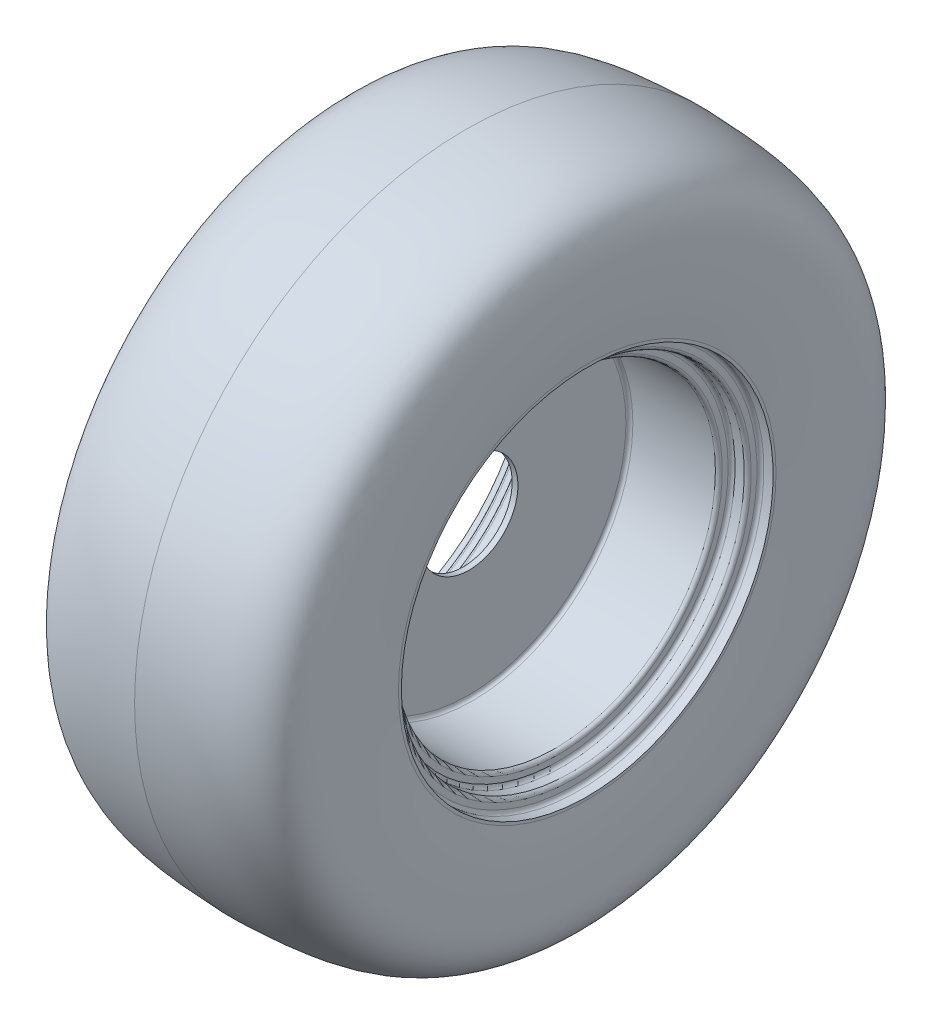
ISO-10303-21;
HEADER;
FILE_DESCRIPTION(('STEP AP214'),'2;1');
FILE_NAME('part.step','',(''),(''),'','','');
FILE_SCHEMA(('AUTOMOTIVE_DESIGN { 1 0 10303 214 1 1 1 1 }'));
ENDSEC;
DATA;
#1=APPLICATION_CONTEXT('core data for automotive mechanical design processes');
#2=APPLICATION_PROTOCOL_DEFINITION('international standard','automotive_design',2000,#1);
#3=PRODUCT_CONTEXT('',#1,'mechanical');
#4=PRODUCT('Part','Part','',(#3));
#5=PRODUCT_RELATED_PRODUCT_CATEGORY('part','',(#4));
#6=PRODUCT_DEFINITION_FORMATION('','',#4);
#7=PRODUCT_DEFINITION_CONTEXT('part definition',#1,'design');
#8=PRODUCT_DEFINITION('design','',#6,#7);
#9=PRODUCT_DEFINITION_SHAPE('','',#8);
#10=(LENGTH_UNIT() NAMED_UNIT(*) SI_UNIT(.MILLI.,.METRE.));
#11=(NAMED_UNIT(*) PLANE_ANGLE_UNIT() SI_UNIT($,.RADIAN.));
#12=(NAMED_UNIT(*) SI_UNIT($,.STERADIAN.) SOLID_ANGLE_UNIT());
#13=UNCERTAINTY_MEASURE_WITH_UNIT(LENGTH_MEASURE(1.E-05),#10,'distance_accuracy_value','');
#14=(GEOMETRIC_REPRESENTATION_CONTEXT(3) GLOBAL_UNCERTAINTY_ASSIGNED_CONTEXT((#13)) GLOBAL_UNIT_ASSIGNED_CONTEXT((#10,
#11,#12)) REPRESENTATION_CONTEXT('',''));
#15=CARTESIAN_POINT('',(0.,0.,0.));
#16=DIRECTION('',(0.,0.,1.));
#17=DIRECTION('',(1.,0.,0.));
#18=AXIS2_PLACEMENT_3D('',#15,#16,#17);
#19=CARTESIAN_POINT('',(105.,0.,-163.5));
#20=CARTESIAN_POINT('',(105.739330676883,0.,-172.08092103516));
#21=CARTESIAN_POINT('',(107.459659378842,0.,-192.047635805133));
#22=CARTESIAN_POINT('',(107.400956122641,0.,-220.381127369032));
#23=CARTESIAN_POINT('',(109.617233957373,0.,-283.009080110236));
#24=CARTESIAN_POINT('',(48.8582227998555,0.,-285.221180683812));
#25=CARTESIAN_POINT('',(0.,0.,-287.));
#26=B_SPLINE_CURVE_WITH_KNOTS('',3,(#19,#20,#21,#22,#23,#24,#25),.UNSPECIFIED.,.F.,.F.,(4,1,1,1,
4),(0.,0.128976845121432,0.300112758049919,0.437198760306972,1.),.UNSPECIFIED.);
#27=CARTESIAN_POINT('',(-61.1869721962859,0.,0.));
#28=DIRECTION('',(-1.,0.,0.));
#29=AXIS1_PLACEMENT('',#27,#28);
#30=SURFACE_OF_REVOLUTION('',#26,#29);
#31=CARTESIAN_POINT('',(0.,0.,0.));
#32=DIRECTION('',(-1.,0.,0.));
#33=DIRECTION('',(0.,0.,1.));
#34=AXIS2_PLACEMENT_3D('',#31,#32,#33);
#35=CIRCLE('',#34,287.);
#36=CARTESIAN_POINT('',(0.,0.,287.));
#37=VERTEX_POINT('',#36);
#38=EDGE_CURVE('E10',#37,#37,#35,.T.);
#39=ORIENTED_EDGE('',*,*,#38,.F.);
#40=EDGE_LOOP('',(#39));
#41=FACE_BOUND('',#40,.T.);
#42=CARTESIAN_POINT('',(105.,0.,0.));
#43=DIRECTION('',(-1.,0.,0.));
#44=DIRECTION('',(0.,0.,1.));
#45=AXIS2_PLACEMENT_3D('',#42,#43,#44);
#46=CIRCLE('',#45,163.5);
#47=CARTESIAN_POINT('',(105.,0.,163.5));
#48=VERTEX_POINT('',#47);
#49=EDGE_CURVE('E115',#48,#48,#46,.T.);
#50=ORIENTED_EDGE('',*,*,#49,.T.);
#51=EDGE_LOOP('',(#50));
#52=FACE_BOUND('',#51,.T.);
#53=ADVANCED_FACE('F29',(#41,#52),#30,.T.);
#54=CARTESIAN_POINT('',(0.,0.,-287.));
#55=CARTESIAN_POINT('',(-48.8582227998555,0.,-285.221180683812));
#56=CARTESIAN_POINT('',(-109.617233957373,0.,-283.009080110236));
#57=CARTESIAN_POINT('',(-107.400956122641,0.,-220.381127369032));
#58=CARTESIAN_POINT('',(-107.459659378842,0.,-192.047635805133));
#59=CARTESIAN_POINT('',(-105.739330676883,0.,-172.08092103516));
#60=CARTESIAN_POINT('',(-105.,0.,-163.5));
#61=B_SPLINE_CURVE_WITH_KNOTS('',3,(#54,#55,#56,#57,#58,#59,#60),.UNSPECIFIED.,.F.,.F.,(4,1,1,1,
4),(0.,0.562801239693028,0.699887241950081,0.871023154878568,1.),.UNSPECIFIED.);
#62=CARTESIAN_POINT('',(-61.1869721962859,0.,0.));
#63=DIRECTION('',(-1.,0.,0.));
#64=AXIS1_PLACEMENT('',#62,#63);
#65=SURFACE_OF_REVOLUTION('',#61,#64);
#66=CARTESIAN_POINT('',(-105.,0.,0.));
#67=DIRECTION('',(-1.,0.,0.));
#68=DIRECTION('',(0.,0.,1.));
#69=AXIS2_PLACEMENT_3D('',#66,#67,#68);
#70=CIRCLE('',#69,163.5);
#71=CARTESIAN_POINT('',(-105.,0.,163.5));
#72=VERTEX_POINT('',#71);
#73=EDGE_CURVE('E36',#72,#72,#70,.T.);
#74=ORIENTED_EDGE('',*,*,#73,.F.);
#75=EDGE_LOOP('',(#74));
#76=FACE_BOUND('',#75,.T.);
#77=ORIENTED_EDGE('',*,*,#38,.T.);
#78=EDGE_LOOP('',(#77));
#79=FACE_BOUND('',#78,.T.);
#80=ADVANCED_FACE('F127',(#76,#79),#65,.T.);
#81=CARTESIAN_POINT('',(-105.,0.,-163.5));
#82=DIRECTION('',(1.,0.,0.));
#83=DIRECTION('',(0.,0.,-1.));
#84=AXIS2_PLACEMENT_3D('',#81,#82,#83);
#85=PLANE('',#84);
#86=CARTESIAN_POINT('',(-105.,0.,0.));
#87=DIRECTION('',(-1.,0.,0.));
#88=DIRECTION('',(0.,0.,1.));
#89=AXIS2_PLACEMENT_3D('',#86,#87,#88);
#90=CIRCLE('',#89,161.);
#91=CARTESIAN_POINT('',(-105.,0.,161.));
#92=VERTEX_POINT('',#91);
#93=EDGE_CURVE('E40',#92,#92,#90,.T.);
#94=ORIENTED_EDGE('',*,*,#93,.F.);
#95=EDGE_LOOP('',(#94));
#96=FACE_BOUND('',#95,.T.);
#97=ORIENTED_EDGE('',*,*,#73,.T.);
#98=EDGE_LOOP('',(#97));
#99=FACE_BOUND('',#98,.T.);
#100=ADVANCED_FACE('F130',(#96,#99),#85,.F.);
#101=CARTESIAN_POINT('',(-61.1869721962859,0.,0.));
#102=DIRECTION('',(-1.,0.,0.));
#103=DIRECTION('',(0.,0.,1.));
#104=AXIS2_PLACEMENT_3D('',#101,#102,#103);
#105=CYLINDRICAL_SURFACE('',#104,161.);
#106=CARTESIAN_POINT('',(-97.,0.,0.));
#107=DIRECTION('',(-1.,0.,0.));
#108=DIRECTION('',(0.,0.,1.));
#109=AXIS2_PLACEMENT_3D('',#106,#107,#108);
#110=CIRCLE('',#109,161.);
#111=CARTESIAN_POINT('',(-97.,0.,161.));
#112=VERTEX_POINT('',#111);
#113=EDGE_CURVE('E44',#112,#112,#110,.T.);
#114=ORIENTED_EDGE('',*,*,#113,.F.);
#115=EDGE_LOOP('',(#114));
#116=FACE_BOUND('',#115,.T.);
#117=ORIENTED_EDGE('',*,*,#93,.T.);
#118=EDGE_LOOP('',(#117));
#119=FACE_BOUND('',#118,.T.);
#120=ADVANCED_FACE('F134',(#116,#119),#105,.F.);
#121=CARTESIAN_POINT('',(-97.,0.,0.));
#122=DIRECTION('',(-1.,0.,0.));
#123=DIRECTION('',(0.,0.,1.));
#124=AXIS2_PLACEMENT_3D('',#121,#122,#123);
#125=TOROIDAL_SURFACE('',#124,158.,3.);
#126=CARTESIAN_POINT('',(-94.,0.,0.));
#127=DIRECTION('',(-1.,0.,0.));
#128=DIRECTION('',(0.,0.,1.));
#129=AXIS2_PLACEMENT_3D('',#126,#127,#128);
#130=CIRCLE('',#129,158.);
#131=CARTESIAN_POINT('',(-94.,0.,158.));
#132=VERTEX_POINT('',#131);
#133=EDGE_CURVE('E49',#132,#132,#130,.T.);
#134=ORIENTED_EDGE('',*,*,#133,.F.);
#135=EDGE_LOOP('',(#134));
#136=FACE_BOUND('',#135,.T.);
#137=ORIENTED_EDGE('',*,*,#113,.T.);
#138=EDGE_LOOP('',(#137));
#139=FACE_BOUND('',#138,.T.);
#140=ADVANCED_FACE('F138',(#136,#139),#125,.F.);
#141=CARTESIAN_POINT('',(-94.,0.,-158.));
#142=DIRECTION('',(1.,0.,0.));
#143=DIRECTION('',(0.,0.,-1.));
#144=AXIS2_PLACEMENT_3D('',#141,#142,#143);
#145=PLANE('',#144);
#146=CARTESIAN_POINT('',(-94.,0.,0.));
#147=DIRECTION('',(-1.,0.,0.));
#148=DIRECTION('',(0.,0.,1.));
#149=AXIS2_PLACEMENT_3D('',#146,#147,#148);
#150=CIRCLE('',#149,153.);
#151=CARTESIAN_POINT('',(-94.,0.,153.));
#152=VERTEX_POINT('',#151);
#153=EDGE_CURVE('E52',#152,#152,#150,.T.);
#154=ORIENTED_EDGE('',*,*,#153,.F.);
#155=EDGE_LOOP('',(#154));
#156=FACE_BOUND('',#155,.T.);
#157=ORIENTED_EDGE('',*,*,#133,.T.);
#158=EDGE_LOOP('',(#157));
#159=FACE_BOUND('',#158,.T.);
#160=ADVANCED_FACE('F142',(#156,#159),#145,.F.);
#161=CARTESIAN_POINT('',(-91.,0.,0.));
#162=DIRECTION('',(-1.,0.,0.));
#163=DIRECTION('',(0.,0.,1.));
#164=AXIS2_PLACEMENT_3D('',#161,#162,#163);
#165=TOROIDAL_SURFACE('',#164,153.,3.);
#166=CARTESIAN_POINT('',(-91.,0.,0.));
#167=DIRECTION('',(-1.,0.,0.));
#168=DIRECTION('',(0.,0.,1.));
#169=AXIS2_PLACEMENT_3D('',#166,#167,#168);
#170=CIRCLE('',#169,150.);
#171=CARTESIAN_POINT('',(-91.,0.,150.));
#172=VERTEX_POINT('',#171);
#173=EDGE_CURVE('E55',#172,#172,#170,.T.);
#174=ORIENTED_EDGE('',*,*,#173,.F.);
#175=EDGE_LOOP('',(#174));
#176=FACE_BOUND('',#175,.T.);
#177=ORIENTED_EDGE('',*,*,#153,.T.);
#178=EDGE_LOOP('',(#177));
#179=FACE_BOUND('',#178,.T.);
#180=ADVANCED_FACE('F146',(#176,#179),#165,.T.);
#181=CARTESIAN_POINT('',(-61.1869721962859,0.,0.));
#182=DIRECTION('',(-1.,0.,0.));
#183=DIRECTION('',(0.,0.,1.));
#184=AXIS2_PLACEMENT_3D('',#181,#182,#183);
#185=CYLINDRICAL_SURFACE('',#184,150.);
#186=CARTESIAN_POINT('',(-83.,0.,0.));
#187=DIRECTION('',(-1.,0.,0.));
#188=DIRECTION('',(0.,0.,1.));
#189=AXIS2_PLACEMENT_3D('',#186,#187,#188);
#190=CIRCLE('',#189,150.);
#191=CARTESIAN_POINT('',(-83.,0.,150.));
#192=VERTEX_POINT('',#191);
#193=EDGE_CURVE('E58',#192,#192,#190,.T.);
#194=ORIENTED_EDGE('',*,*,#193,.F.);
#195=EDGE_LOOP('',(#194));
#196=FACE_BOUND('',#195,.T.);
#197=ORIENTED_EDGE('',*,*,#173,.T.);
#198=EDGE_LOOP('',(#197));
#199=FACE_BOUND('',#198,.T.);
#200=ADVANCED_FACE('F150',(#196,#199),#185,.F.);
#201=CARTESIAN_POINT('',(-83.,0.,0.));
#202=DIRECTION('',(-1.,0.,0.));
#203=DIRECTION('',(0.,0.,1.));
#204=AXIS2_PLACEMENT_3D('',#201,#202,#203);
#205=TOROIDAL_SURFACE('',#204,147.,3.);
#206=CARTESIAN_POINT('',(-80.,0.,0.));
#207=DIRECTION('',(-1.,0.,0.));
#208=DIRECTION('',(0.,0.,1.));
#209=AXIS2_PLACEMENT_3D('',#206,#207,#208);
#210=CIRCLE('',#209,147.);
#211=CARTESIAN_POINT('',(-80.,0.,147.));
#212=VERTEX_POINT('',#211);
#213=EDGE_CURVE('E61',#212,#212,#210,.T.);
#214=ORIENTED_EDGE('',*,*,#213,.F.);
#215=EDGE_LOOP('',(#214));
#216=FACE_BOUND('',#215,.T.);
#217=ORIENTED_EDGE('',*,*,#193,.T.);
#218=EDGE_LOOP('',(#217));
#219=FACE_BOUND('',#218,.T.);
#220=ADVANCED_FACE('F154',(#216,#219),#205,.F.);
#221=CARTESIAN_POINT('',(-80.,0.,-147.));
#222=DIRECTION('',(1.,0.,0.));
#223=DIRECTION('',(0.,0.,-1.));
#224=AXIS2_PLACEMENT_3D('',#221,#222,#223);
#225=PLANE('',#224);
#226=CARTESIAN_POINT('',(-80.,0.,0.));
#227=DIRECTION('',(-1.,0.,0.));
#228=DIRECTION('',(0.,0.,1.));
#229=AXIS2_PLACEMENT_3D('',#226,#227,#228);
#230=CIRCLE('',#229,142.);
#231=CARTESIAN_POINT('',(-80.,0.,142.));
#232=VERTEX_POINT('',#231);
#233=EDGE_CURVE('E64',#232,#232,#230,.T.);
#234=ORIENTED_EDGE('',*,*,#233,.F.);
#235=EDGE_LOOP('',(#234));
#236=FACE_BOUND('',#235,.T.);
#237=ORIENTED_EDGE('',*,*,#213,.T.);
#238=EDGE_LOOP('',(#237));
#239=FACE_BOUND('',#238,.T.);
#240=ADVANCED_FACE('F158',(#236,#239),#225,.F.);
#241=CARTESIAN_POINT('',(-77.,0.,0.));
#242=DIRECTION('',(-1.,0.,0.));
#243=DIRECTION('',(0.,0.,1.));
#244=AXIS2_PLACEMENT_3D('',#241,#242,#243);
#245=TOROIDAL_SURFACE('',#244,142.,3.);
#246=CARTESIAN_POINT('',(-77.,0.,0.));
#247=DIRECTION('',(-1.,0.,0.));
#248=DIRECTION('',(0.,0.,1.));
#249=AXIS2_PLACEMENT_3D('',#246,#247,#248);
#250=CIRCLE('',#249,139.);
#251=CARTESIAN_POINT('',(-77.,0.,139.));
#252=VERTEX_POINT('',#251);
#253=EDGE_CURVE('E67',#252,#252,#250,.T.);
#254=ORIENTED_EDGE('',*,*,#253,.F.);
#255=EDGE_LOOP('',(#254));
#256=FACE_BOUND('',#255,.T.);
#257=ORIENTED_EDGE('',*,*,#233,.T.);
#258=EDGE_LOOP('',(#257));
#259=FACE_BOUND('',#258,.T.);
#260=ADVANCED_FACE('F162',(#256,#259),#245,.T.);
#261=CARTESIAN_POINT('',(-61.1869721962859,0.,0.));
#262=DIRECTION('',(-1.,0.,0.));
#263=DIRECTION('',(0.,0.,1.));
#264=AXIS2_PLACEMENT_3D('',#261,#262,#263);
#265=CYLINDRICAL_SURFACE('',#264,139.);
#266=CARTESIAN_POINT('',(-5.50000000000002,0.,0.));
#267=DIRECTION('',(-1.,0.,0.));
#268=DIRECTION('',(0.,0.,1.));
#269=AXIS2_PLACEMENT_3D('',#266,#267,#268);
#270=CIRCLE('',#269,139.);
#271=CARTESIAN_POINT('',(-5.50000000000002,0.,139.));
#272=VERTEX_POINT('',#271);
#273=EDGE_CURVE('E70',#272,#272,#270,.T.);
#274=ORIENTED_EDGE('',*,*,#273,.F.);
#275=EDGE_LOOP('',(#274));
#276=FACE_BOUND('',#275,.T.);
#277=ORIENTED_EDGE('',*,*,#253,.T.);
#278=EDGE_LOOP('',(#277));
#279=FACE_BOUND('',#278,.T.);
#280=ADVANCED_FACE('F166',(#276,#279),#265,.F.);
#281=CARTESIAN_POINT('',(-5.5,0.,0.));
#282=DIRECTION('',(-1.,0.,0.));
#283=DIRECTION('',(0.,0.,1.));
#284=AXIS2_PLACEMENT_3D('',#281,#282,#283);
#285=TOROIDAL_SURFACE('',#284,136.,3.);
#286=CARTESIAN_POINT('',(-2.5,0.,0.));
#287=DIRECTION('',(-1.,0.,0.));
#288=DIRECTION('',(0.,0.,1.));
#289=AXIS2_PLACEMENT_3D('',#286,#287,#288);
#290=CIRCLE('',#289,136.);
#291=CARTESIAN_POINT('',(-2.5,0.,136.));
#292=VERTEX_POINT('',#291);
#293=EDGE_CURVE('E73',#292,#292,#290,.T.);
#294=ORIENTED_EDGE('',*,*,#293,.F.);
#295=EDGE_LOOP('',(#294));
#296=FACE_BOUND('',#295,.T.);
#297=ORIENTED_EDGE('',*,*,#273,.T.);
#298=EDGE_LOOP('',(#297));
#299=FACE_BOUND('',#298,.T.);
#300=ADVANCED_FACE('F170',(#296,#299),#285,.F.);
#301=CARTESIAN_POINT('',(-2.5,0.,-136.));
#302=DIRECTION('',(1.,0.,0.));
#303=DIRECTION('',(0.,0.,-1.));
#304=AXIS2_PLACEMENT_3D('',#301,#302,#303);
#305=PLANE('',#304);
#306=CARTESIAN_POINT('',(-2.49999999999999,0.,0.));
#307=DIRECTION('',(-1.,0.,0.));
#308=DIRECTION('',(0.,0.,1.));
#309=AXIS2_PLACEMENT_3D('',#306,#307,#308);
#310=CIRCLE('',#309,42.5);
#311=CARTESIAN_POINT('',(-2.49999999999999,0.,42.5));
#312=VERTEX_POINT('',#311);
#313=EDGE_CURVE('E76',#312,#312,#310,.T.);
#314=ORIENTED_EDGE('',*,*,#313,.F.);
#315=EDGE_LOOP('',(#314));
#316=FACE_BOUND('',#315,.T.);
#317=ORIENTED_EDGE('',*,*,#293,.T.);
#318=EDGE_LOOP('',(#317));
#319=FACE_BOUND('',#318,.T.);
#320=ADVANCED_FACE('F174',(#316,#319),#305,.F.);
#321=CARTESIAN_POINT('',(-61.1869721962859,0.,0.));
#322=DIRECTION('',(-1.,0.,0.));
#323=DIRECTION('',(0.,0.,1.));
#324=AXIS2_PLACEMENT_3D('',#321,#322,#323);
#325=CYLINDRICAL_SURFACE('',#324,42.5);
#326=CARTESIAN_POINT('',(2.49999999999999,0.,0.));
#327=DIRECTION('',(-1.,0.,0.));
#328=DIRECTION('',(0.,0.,1.));
#329=AXIS2_PLACEMENT_3D('',#326,#327,#328);
#330=CIRCLE('',#329,42.5);
#331=CARTESIAN_POINT('',(2.49999999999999,0.,42.5));
#332=VERTEX_POINT('',#331);
#333=EDGE_CURVE('E79',#332,#332,#330,.T.);
#334=ORIENTED_EDGE('',*,*,#333,.F.);
#335=EDGE_LOOP('',(#334));
#336=FACE_BOUND('',#335,.T.);
#337=ORIENTED_EDGE('',*,*,#313,.T.);
#338=EDGE_LOOP('',(#337));
#339=FACE_BOUND('',#338,.T.);
#340=ADVANCED_FACE('F178',(#336,#339),#325,.F.);
#341=CARTESIAN_POINT('',(2.5,0.,-136.));
#342=DIRECTION('',(-1.,0.,0.));
#343=DIRECTION('',(0.,0.,1.));
#344=AXIS2_PLACEMENT_3D('',#341,#342,#343);
#345=PLANE('',#344);
#346=CARTESIAN_POINT('',(2.5,0.,0.));
#347=DIRECTION('',(-1.,0.,0.));
#348=DIRECTION('',(0.,0.,1.));
#349=AXIS2_PLACEMENT_3D('',#346,#347,#348);
#350=CIRCLE('',#349,136.);
#351=CARTESIAN_POINT('',(2.5,0.,136.));
#352=VERTEX_POINT('',#351);
#353=EDGE_CURVE('E82',#352,#352,#350,.T.);
#354=ORIENTED_EDGE('',*,*,#353,.F.);
#355=EDGE_LOOP('',(#354));
#356=FACE_BOUND('',#355,.T.);
#357=ORIENTED_EDGE('',*,*,#333,.T.);
#358=EDGE_LOOP('',(#357));
#359=FACE_BOUND('',#358,.T.);
#360=ADVANCED_FACE('F182',(#356,#359),#345,.F.);
#361=CARTESIAN_POINT('',(5.5,0.,0.));
#362=DIRECTION('',(-1.,0.,0.));
#363=DIRECTION('',(0.,0.,1.));
#364=AXIS2_PLACEMENT_3D('',#361,#362,#363);
#365=TOROIDAL_SURFACE('',#364,136.,3.);
#366=CARTESIAN_POINT('',(5.50000000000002,0.,0.));
#367=DIRECTION('',(-1.,0.,0.));
#368=DIRECTION('',(0.,0.,1.));
#369=AXIS2_PLACEMENT_3D('',#366,#367,#368);
#370=CIRCLE('',#369,139.);
#371=CARTESIAN_POINT('',(5.50000000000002,0.,139.));
#372=VERTEX_POINT('',#371);
#373=EDGE_CURVE('E85',#372,#372,#370,.T.);
#374=ORIENTED_EDGE('',*,*,#373,.F.);
#375=EDGE_LOOP('',(#374));
#376=FACE_BOUND('',#375,.T.);
#377=ORIENTED_EDGE('',*,*,#353,.T.);
#378=EDGE_LOOP('',(#377));
#379=FACE_BOUND('',#378,.T.);
#380=ADVANCED_FACE('F186',(#376,#379),#365,.F.);
#381=CARTESIAN_POINT('',(-61.1869721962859,0.,0.));
#382=DIRECTION('',(-1.,0.,0.));
#383=DIRECTION('',(0.,0.,1.));
#384=AXIS2_PLACEMENT_3D('',#381,#382,#383);
#385=CYLINDRICAL_SURFACE('',#384,139.);
#386=CARTESIAN_POINT('',(77.,0.,0.));
#387=DIRECTION('',(-1.,0.,0.));
#388=DIRECTION('',(0.,0.,1.));
#389=AXIS2_PLACEMENT_3D('',#386,#387,#388);
#390=CIRCLE('',#389,139.);
#391=CARTESIAN_POINT('',(77.,0.,139.));
#392=VERTEX_POINT('',#391);
#393=EDGE_CURVE('E88',#392,#392,#390,.T.);
#394=ORIENTED_EDGE('',*,*,#393,.F.);
#395=EDGE_LOOP('',(#394));
#396=FACE_BOUND('',#395,.T.);
#397=ORIENTED_EDGE('',*,*,#373,.T.);
#398=EDGE_LOOP('',(#397));
#399=FACE_BOUND('',#398,.T.);
#400=ADVANCED_FACE('F190',(#396,#399),#385,.F.);
#401=CARTESIAN_POINT('',(77.,0.,0.));
#402=DIRECTION('',(-1.,0.,0.));
#403=DIRECTION('',(0.,0.,1.));
#404=AXIS2_PLACEMENT_3D('',#401,#402,#403);
#405=TOROIDAL_SURFACE('',#404,142.,3.);
#406=CARTESIAN_POINT('',(80.,0.,0.));
#407=DIRECTION('',(-1.,0.,0.));
#408=DIRECTION('',(0.,0.,1.));
#409=AXIS2_PLACEMENT_3D('',#406,#407,#408);
#410=CIRCLE('',#409,142.);
#411=CARTESIAN_POINT('',(80.,0.,142.));
#412=VERTEX_POINT('',#411);
#413=EDGE_CURVE('E91',#412,#412,#410,.T.);
#414=ORIENTED_EDGE('',*,*,#413,.F.);
#415=EDGE_LOOP('',(#414));
#416=FACE_BOUND('',#415,.T.);
#417=ORIENTED_EDGE('',*,*,#393,.T.);
#418=EDGE_LOOP('',(#417));
#419=FACE_BOUND('',#418,.T.);
#420=ADVANCED_FACE('F194',(#416,#419),#405,.T.);
#421=CARTESIAN_POINT('',(80.,0.,-147.));
#422=DIRECTION('',(-1.,0.,0.));
#423=DIRECTION('',(0.,0.,1.));
#424=AXIS2_PLACEMENT_3D('',#421,#422,#423);
#425=PLANE('',#424);
#426=CARTESIAN_POINT('',(80.,0.,0.));
#427=DIRECTION('',(-1.,0.,0.));
#428=DIRECTION('',(0.,0.,1.));
#429=AXIS2_PLACEMENT_3D('',#426,#427,#428);
#430=CIRCLE('',#429,147.);
#431=CARTESIAN_POINT('',(80.,0.,147.));
#432=VERTEX_POINT('',#431);
#433=EDGE_CURVE('E94',#432,#432,#430,.T.);
#434=ORIENTED_EDGE('',*,*,#433,.F.);
#435=EDGE_LOOP('',(#434));
#436=FACE_BOUND('',#435,.T.);
#437=ORIENTED_EDGE('',*,*,#413,.T.);
#438=EDGE_LOOP('',(#437));
#439=FACE_BOUND('',#438,.T.);
#440=ADVANCED_FACE('F198',(#436,#439),#425,.F.);
#441=CARTESIAN_POINT('',(83.,0.,0.));
#442=DIRECTION('',(-1.,0.,0.));
#443=DIRECTION('',(0.,0.,1.));
#444=AXIS2_PLACEMENT_3D('',#441,#442,#443);
#445=TOROIDAL_SURFACE('',#444,147.,3.);
#446=CARTESIAN_POINT('',(83.,0.,0.));
#447=DIRECTION('',(-1.,0.,0.));
#448=DIRECTION('',(0.,0.,1.));
#449=AXIS2_PLACEMENT_3D('',#446,#447,#448);
#450=CIRCLE('',#449,150.);
#451=CARTESIAN_POINT('',(83.,0.,150.));
#452=VERTEX_POINT('',#451);
#453=EDGE_CURVE('E97',#452,#452,#450,.T.);
#454=ORIENTED_EDGE('',*,*,#453,.F.);
#455=EDGE_LOOP('',(#454));
#456=FACE_BOUND('',#455,.T.);
#457=ORIENTED_EDGE('',*,*,#433,.T.);
#458=EDGE_LOOP('',(#457));
#459=FACE_BOUND('',#458,.T.);
#460=ADVANCED_FACE('F202',(#456,#459),#445,.F.);
#461=CARTESIAN_POINT('',(-61.1869721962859,0.,0.));
#462=DIRECTION('',(-1.,0.,0.));
#463=DIRECTION('',(0.,0.,1.));
#464=AXIS2_PLACEMENT_3D('',#461,#462,#463);
#465=CYLINDRICAL_SURFACE('',#464,150.);
#466=CARTESIAN_POINT('',(91.,0.,0.));
#467=DIRECTION('',(-1.,0.,0.));
#468=DIRECTION('',(0.,0.,1.));
#469=AXIS2_PLACEMENT_3D('',#466,#467,#468);
#470=CIRCLE('',#469,150.);
#471=CARTESIAN_POINT('',(91.,0.,150.));
#472=VERTEX_POINT('',#471);
#473=EDGE_CURVE('E100',#472,#472,#470,.T.);
#474=ORIENTED_EDGE('',*,*,#473,.F.);
#475=EDGE_LOOP('',(#474));
#476=FACE_BOUND('',#475,.T.);
#477=ORIENTED_EDGE('',*,*,#453,.T.);
#478=EDGE_LOOP('',(#477));
#479=FACE_BOUND('',#478,.T.);
#480=ADVANCED_FACE('F206',(#476,#479),#465,.F.);
#481=CARTESIAN_POINT('',(91.,0.,0.));
#482=DIRECTION('',(-1.,0.,0.));
#483=DIRECTION('',(0.,0.,1.));
#484=AXIS2_PLACEMENT_3D('',#481,#482,#483);
#485=TOROIDAL_SURFACE('',#484,153.,3.);
#486=CARTESIAN_POINT('',(94.,0.,0.));
#487=DIRECTION('',(-1.,0.,0.));
#488=DIRECTION('',(0.,0.,1.));
#489=AXIS2_PLACEMENT_3D('',#486,#487,#488);
#490=CIRCLE('',#489,153.);
#491=CARTESIAN_POINT('',(94.,0.,153.));
#492=VERTEX_POINT('',#491);
#493=EDGE_CURVE('E103',#492,#492,#490,.T.);
#494=ORIENTED_EDGE('',*,*,#493,.F.);
#495=EDGE_LOOP('',(#494));
#496=FACE_BOUND('',#495,.T.);
#497=ORIENTED_EDGE('',*,*,#473,.T.);
#498=EDGE_LOOP('',(#497));
#499=FACE_BOUND('',#498,.T.);
#500=ADVANCED_FACE('F210',(#496,#499),#485,.T.);
#501=CARTESIAN_POINT('',(94.,0.,-158.));
#502=DIRECTION('',(-1.,0.,0.));
#503=DIRECTION('',(0.,0.,1.));
#504=AXIS2_PLACEMENT_3D('',#501,#502,#503);
#505=PLANE('',#504);
#506=CARTESIAN_POINT('',(94.,0.,0.));
#507=DIRECTION('',(-1.,0.,0.));
#508=DIRECTION('',(0.,0.,1.));
#509=AXIS2_PLACEMENT_3D('',#506,#507,#508);
#510=CIRCLE('',#509,158.);
#511=CARTESIAN_POINT('',(94.,0.,158.));
#512=VERTEX_POINT('',#511);
#513=EDGE_CURVE('E106',#512,#512,#510,.T.);
#514=ORIENTED_EDGE('',*,*,#513,.F.);
#515=EDGE_LOOP('',(#514));
#516=FACE_BOUND('',#515,.T.);
#517=ORIENTED_EDGE('',*,*,#493,.T.);
#518=EDGE_LOOP('',(#517));
#519=FACE_BOUND('',#518,.T.);
#520=ADVANCED_FACE('F214',(#516,#519),#505,.F.);
#521=CARTESIAN_POINT('',(97.,0.,0.));
#522=DIRECTION('',(-1.,0.,0.));
#523=DIRECTION('',(0.,0.,1.));
#524=AXIS2_PLACEMENT_3D('',#521,#522,#523);
#525=TOROIDAL_SURFACE('',#524,158.,3.);
#526=CARTESIAN_POINT('',(97.,0.,0.));
#527=DIRECTION('',(-1.,0.,0.));
#528=DIRECTION('',(0.,0.,1.));
#529=AXIS2_PLACEMENT_3D('',#526,#527,#528);
#530=CIRCLE('',#529,161.);
#531=CARTESIAN_POINT('',(97.,0.,161.));
#532=VERTEX_POINT('',#531);
#533=EDGE_CURVE('E109',#532,#532,#530,.T.);
#534=ORIENTED_EDGE('',*,*,#533,.F.);
#535=EDGE_LOOP('',(#534));
#536=FACE_BOUND('',#535,.T.);
#537=ORIENTED_EDGE('',*,*,#513,.T.);
#538=EDGE_LOOP('',(#537));
#539=FACE_BOUND('',#538,.T.);
#540=ADVANCED_FACE('F218',(#536,#539),#525,.F.);
#541=CARTESIAN_POINT('',(-61.1869721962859,0.,0.));
#542=DIRECTION('',(-1.,0.,0.));
#543=DIRECTION('',(0.,0.,1.));
#544=AXIS2_PLACEMENT_3D('',#541,#542,#543);
#545=CYLINDRICAL_SURFACE('',#544,161.);
#546=CARTESIAN_POINT('',(105.,0.,0.));
#547=DIRECTION('',(-1.,0.,0.));
#548=DIRECTION('',(0.,0.,1.));
#549=AXIS2_PLACEMENT_3D('',#546,#547,#548);
#550=CIRCLE('',#549,161.);
#551=CARTESIAN_POINT('',(105.,0.,161.));
#552=VERTEX_POINT('',#551);
#553=EDGE_CURVE('E112',#552,#552,#550,.T.);
#554=ORIENTED_EDGE('',*,*,#553,.F.);
#555=EDGE_LOOP('',(#554));
#556=FACE_BOUND('',#555,.T.);
#557=ORIENTED_EDGE('',*,*,#533,.T.);
#558=EDGE_LOOP('',(#557));
#559=FACE_BOUND('',#558,.T.);
#560=ADVANCED_FACE('F222',(#556,#559),#545,.F.);
#561=CARTESIAN_POINT('',(105.,0.,-163.5));
#562=DIRECTION('',(-1.,0.,0.));
#563=DIRECTION('',(0.,0.,1.));
#564=AXIS2_PLACEMENT_3D('',#561,#562,#563);
#565=PLANE('',#564);
#566=ORIENTED_EDGE('',*,*,#49,.F.);
#567=EDGE_LOOP('',(#566));
#568=FACE_BOUND('',#567,.T.);
#569=ORIENTED_EDGE('',*,*,#553,.T.);
#570=EDGE_LOOP('',(#569));
#571=FACE_BOUND('',#570,.T.);
#572=ADVANCED_FACE('F226',(#568,#571),#565,.F.);
#573=CLOSED_SHELL('',(#53,#80,#100,#120,#140,#160,#180,#200,#220,#240,#260,#280,#300,#320,#340,
#360,#380,#400,#420,#440,#460,#480,#500,#520,#540,#560,#572));
#574=MANIFOLD_SOLID_BREP('B2',#573);
#575=ADVANCED_BREP_SHAPE_REPRESENTATION('',(#18,#574),#14);
#576=SHAPE_DEFINITION_REPRESENTATION(#9,#575);
ENDSEC;
END-ISO-10303-21;
